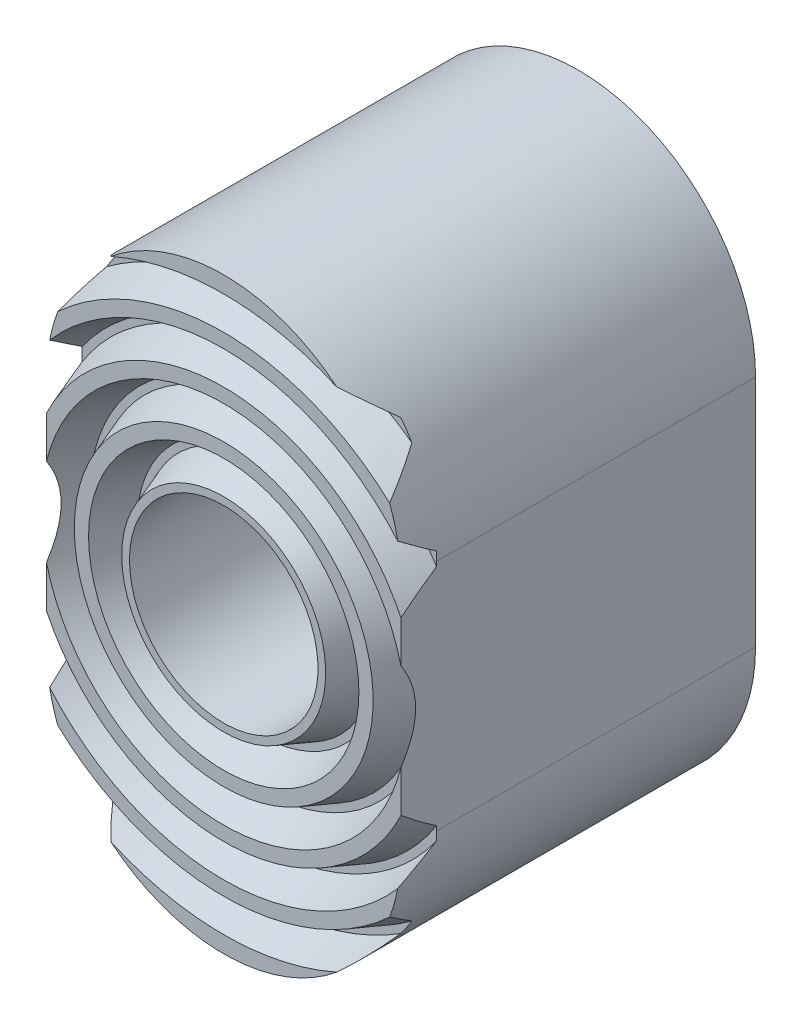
from build123d import *

# Parameters (mm, degrees)
BOSS_EXTRUDE1_DEPTH    = 7.5946
F_10_32_TAPPED_HOLE1_D = 4.0386


with BuildPart() as part:
    # Sketch1 → Boss-Extrude1 (new body)
    with BuildSketch(Plane.XY):
        with BuildLine():
            Line((-3.7973, -2.5019), (-3.7973, 2.5019))
            ThreePointArc((-3.7973, 2.5019), (0, 6.2992), (3.7973, 2.5019))
            Line((3.7973, 2.5019), (3.7973, -2.5019))
            ThreePointArc((3.7973, -2.5019), (0, -6.2992), (-3.7973, -2.5019))
        make_face()
    extrude(amount=BOSS_EXTRUDE1_DEPTH)

    # Sketch3 → Cut-Revolve1 (revolve, cut)
    with BuildSketch(Plane(origin=(0, 0, 0), x_dir=(0, 0, -1), z_dir=(1, 0, 0)), mode=Mode.PRIVATE) as cut_revolve1_sk:
        Polygon((-6.8326, 2.461745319), (-7.5946, 2.1844), (-7.5946, 2.8956), (-6.8326, 2.618254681), align=None)
        Polygon((-6.8326, 5.666254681), (-6.8326, 5.509745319), (-7.5946, 5.2324), (-7.5946, 5.9436), align=None)
        Polygon((-6.8326, 3.634254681), (-7.5946, 3.9116), (-7.5946, 3.2004), (-6.8326, 3.477745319), align=None)
        Polygon((-6.8326, 4.650254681), (-7.5946, 4.9276), (-7.5946, 4.2164), (-6.8326, 4.493745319), align=None)
    revolve(cut_revolve1_sk.sketch.rotate(Axis((0, 0, 0), (0, 0, 1)), 90), axis=Axis((0, 0, 0), (0, 0, 1)), mode=Mode.SUBTRACT)

    # 10-32 Tapped Hole1 (through all)
    with Locations(Plane(origin=(0, 0, 0), x_dir=(-1, 0, 0), z_dir=(0, 0, -1))):
        with Locations((0, 0)):
            Hole(F_10_32_TAPPED_HOLE1_D / 2)


solid = part.part
